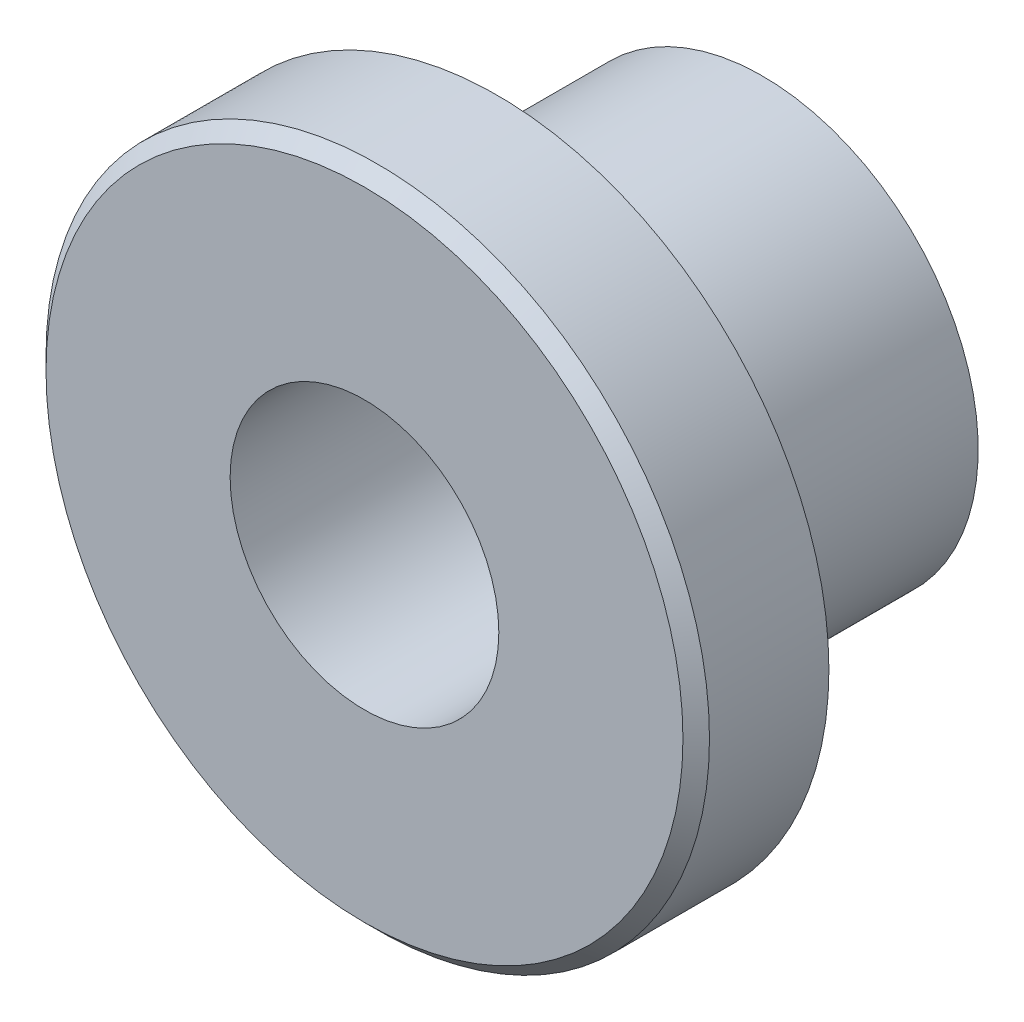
ISO-10303-21;
HEADER;
FILE_DESCRIPTION(('STEP AP214'),'2;1');
FILE_NAME('part.step','',(''),(''),'','','');
FILE_SCHEMA(('AUTOMOTIVE_DESIGN { 1 0 10303 214 1 1 1 1 }'));
ENDSEC;
DATA;
#1=APPLICATION_CONTEXT('core data for automotive mechanical design processes');
#2=APPLICATION_PROTOCOL_DEFINITION('international standard','automotive_design',2000,#1);
#3=PRODUCT_CONTEXT('',#1,'mechanical');
#4=PRODUCT('Part','Part','',(#3));
#5=PRODUCT_RELATED_PRODUCT_CATEGORY('part','',(#4));
#6=PRODUCT_DEFINITION_FORMATION('','',#4);
#7=PRODUCT_DEFINITION_CONTEXT('part definition',#1,'design');
#8=PRODUCT_DEFINITION('design','',#6,#7);
#9=PRODUCT_DEFINITION_SHAPE('','',#8);
#10=(LENGTH_UNIT() NAMED_UNIT(*) SI_UNIT(.MILLI.,.METRE.));
#11=(NAMED_UNIT(*) PLANE_ANGLE_UNIT() SI_UNIT($,.RADIAN.));
#12=(NAMED_UNIT(*) SI_UNIT($,.STERADIAN.) SOLID_ANGLE_UNIT());
#13=UNCERTAINTY_MEASURE_WITH_UNIT(LENGTH_MEASURE(1.E-05),#10,'distance_accuracy_value','');
#14=(GEOMETRIC_REPRESENTATION_CONTEXT(3) GLOBAL_UNCERTAINTY_ASSIGNED_CONTEXT((#13)) GLOBAL_UNIT_ASSIGNED_CONTEXT((#10,
#11,#12)) REPRESENTATION_CONTEXT('',''));
#15=CARTESIAN_POINT('',(0.,0.,0.));
#16=DIRECTION('',(0.,0.,1.));
#17=DIRECTION('',(1.,0.,0.));
#18=AXIS2_PLACEMENT_3D('',#15,#16,#17);
#19=CARTESIAN_POINT('',(0.,0.,-0.4));
#20=DIRECTION('',(0.,0.,1.));
#21=DIRECTION('',(1.,0.,0.));
#22=AXIS2_PLACEMENT_3D('',#19,#20,#21);
#23=TOROIDAL_SURFACE('',#22,6.9,0.4);
#24=CARTESIAN_POINT('',(0.,0.,0.));
#25=DIRECTION('',(0.,0.,-1.));
#26=DIRECTION('',(-1.,0.,0.));
#27=AXIS2_PLACEMENT_3D('',#24,#25,#26);
#28=CIRCLE('',#27,6.9);
#29=CARTESIAN_POINT('',(6.9,0.,0.));
#30=VERTEX_POINT('',#29);
#31=CARTESIAN_POINT('',(-6.9,0.,0.));
#32=VERTEX_POINT('',#31);
#33=EDGE_CURVE('E32',#30,#32,#28,.F.);
#34=ORIENTED_EDGE('',*,*,#33,.F.);
#35=CARTESIAN_POINT('',(0.,0.,0.));
#36=DIRECTION('',(0.,0.,-1.));
#37=DIRECTION('',(1.,0.,0.));
#38=AXIS2_PLACEMENT_3D('',#35,#36,#37);
#39=CIRCLE('',#38,6.9);
#40=EDGE_CURVE('E35',#32,#30,#39,.F.);
#41=ORIENTED_EDGE('',*,*,#40,.F.);
#42=EDGE_LOOP('',(#34,#41));
#43=FACE_BOUND('',#42,.T.);
#44=CARTESIAN_POINT('',(0.,0.,-0.4));
#45=DIRECTION('',(0.,0.,-1.));
#46=DIRECTION('',(-1.,0.,0.));
#47=AXIS2_PLACEMENT_3D('',#44,#45,#46);
#48=CIRCLE('',#47,6.5);
#49=CARTESIAN_POINT('',(-6.5,0.,-0.4));
#50=VERTEX_POINT('',#49);
#51=EDGE_CURVE('E39',#50,#50,#48,.T.);
#52=ORIENTED_EDGE('',*,*,#51,.F.);
#53=EDGE_LOOP('',(#52));
#54=FACE_BOUND('',#53,.T.);
#55=ADVANCED_FACE('F14',(#43,#54),#23,.F.);
#56=CARTESIAN_POINT('',(0.,0.,-0.4));
#57=DIRECTION('',(0.,0.,-1.));
#58=DIRECTION('',(-1.,0.,0.));
#59=AXIS2_PLACEMENT_3D('',#56,#57,#58);
#60=CYLINDRICAL_SURFACE('',#59,6.5);
#61=ORIENTED_EDGE('',*,*,#51,.T.);
#62=EDGE_LOOP('',(#61));
#63=FACE_BOUND('',#62,.T.);
#64=CARTESIAN_POINT('',(0.,0.,-8.));
#65=DIRECTION('',(0.,0.,-1.));
#66=DIRECTION('',(-1.,0.,0.));
#67=AXIS2_PLACEMENT_3D('',#64,#65,#66);
#68=CIRCLE('',#67,6.5);
#69=CARTESIAN_POINT('',(-6.5,0.,-8.));
#70=VERTEX_POINT('',#69);
#71=EDGE_CURVE('E43',#70,#70,#68,.T.);
#72=ORIENTED_EDGE('',*,*,#71,.F.);
#73=EDGE_LOOP('',(#72));
#74=FACE_BOUND('',#73,.T.);
#75=ADVANCED_FACE('F61',(#63,#74),#60,.T.);
#76=CARTESIAN_POINT('',(0.,0.,0.));
#77=DIRECTION('',(0.,0.,-1.));
#78=DIRECTION('',(-1.,0.,0.));
#79=AXIS2_PLACEMENT_3D('',#76,#77,#78);
#80=PLANE('',#79);
#81=CARTESIAN_POINT('',(0.,0.,0.));
#82=DIRECTION('',(0.,0.,1.));
#83=DIRECTION('',(1.,0.,0.));
#84=AXIS2_PLACEMENT_3D('',#81,#82,#83);
#85=CIRCLE('',#84,10.);
#86=CARTESIAN_POINT('',(10.,0.,0.));
#87=VERTEX_POINT('',#86);
#88=EDGE_CURVE('E101',#87,#87,#85,.T.);
#89=ORIENTED_EDGE('',*,*,#88,.F.);
#90=EDGE_LOOP('',(#89));
#91=FACE_BOUND('',#90,.T.);
#92=ORIENTED_EDGE('',*,*,#40,.T.);
#93=ORIENTED_EDGE('',*,*,#33,.T.);
#94=EDGE_LOOP('',(#92,#93));
#95=FACE_BOUND('',#94,.T.);
#96=ADVANCED_FACE('F42',(#91,#95),#80,.T.);
#97=CARTESIAN_POINT('',(0.,0.,-8.));
#98=DIRECTION('',(0.,0.,-1.));
#99=DIRECTION('',(-1.,0.,0.));
#100=AXIS2_PLACEMENT_3D('',#97,#98,#99);
#101=PLANE('',#100);
#102=ORIENTED_EDGE('',*,*,#71,.T.);
#103=EDGE_LOOP('',(#102));
#104=FACE_BOUND('',#103,.T.);
#105=CARTESIAN_POINT('',(0.,0.,-8.));
#106=DIRECTION('',(0.,0.,-1.));
#107=DIRECTION('',(-1.,0.,0.));
#108=AXIS2_PLACEMENT_3D('',#105,#106,#107);
#109=CIRCLE('',#108,4.05);
#110=CARTESIAN_POINT('',(-4.05,0.,-8.));
#111=VERTEX_POINT('',#110);
#112=EDGE_CURVE('E102',#111,#111,#109,.F.);
#113=ORIENTED_EDGE('',*,*,#112,.T.);
#114=EDGE_LOOP('',(#113));
#115=FACE_BOUND('',#114,.T.);
#116=ADVANCED_FACE('F60',(#104,#115),#101,.T.);
#117=CARTESIAN_POINT('',(0.,0.,0.));
#118=DIRECTION('',(0.,0.,1.));
#119=DIRECTION('',(1.,0.,0.));
#120=AXIS2_PLACEMENT_3D('',#117,#118,#119);
#121=CYLINDRICAL_SURFACE('',#120,10.);
#122=CARTESIAN_POINT('',(0.,0.,3.59999999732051));
#123=DIRECTION('',(0.,0.,-1.));
#124=DIRECTION('',(-1.,0.,0.));
#125=AXIS2_PLACEMENT_3D('',#122,#123,#124);
#126=CIRCLE('',#125,9.99999999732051);
#127=CARTESIAN_POINT('',(-9.99999999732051,0.,3.59999999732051));
#128=VERTEX_POINT('',#127);
#129=EDGE_CURVE('E98',#128,#128,#126,.F.);
#130=ORIENTED_EDGE('',*,*,#129,.F.);
#131=EDGE_LOOP('',(#130));
#132=FACE_BOUND('',#131,.T.);
#133=ORIENTED_EDGE('',*,*,#88,.T.);
#134=EDGE_LOOP('',(#133));
#135=FACE_BOUND('',#134,.T.);
#136=ADVANCED_FACE('F87',(#132,#135),#121,.T.);
#137=CARTESIAN_POINT('',(0.,0.,4.));
#138=DIRECTION('',(0.,0.,-1.));
#139=DIRECTION('',(-1.,0.,0.));
#140=AXIS2_PLACEMENT_3D('',#137,#138,#139);
#141=CYLINDRICAL_SURFACE('',#140,4.05);
#142=CARTESIAN_POINT('',(0.,0.,4.));
#143=DIRECTION('',(0.,0.,-1.));
#144=DIRECTION('',(-1.,0.,0.));
#145=AXIS2_PLACEMENT_3D('',#142,#143,#144);
#146=CIRCLE('',#145,4.05);
#147=CARTESIAN_POINT('',(-4.05,0.,4.));
#148=VERTEX_POINT('',#147);
#149=EDGE_CURVE('E25',#148,#148,#146,.T.);
#150=ORIENTED_EDGE('',*,*,#149,.F.);
#151=EDGE_LOOP('',(#150));
#152=FACE_BOUND('',#151,.T.);
#153=ORIENTED_EDGE('',*,*,#112,.F.);
#154=EDGE_LOOP('',(#153));
#155=FACE_BOUND('',#154,.T.);
#156=ADVANCED_FACE('F81',(#152,#155),#141,.F.);
#157=CARTESIAN_POINT('',(0.,0.,3.59999999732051));
#158=DIRECTION('',(0.,0.,-1.));
#159=DIRECTION('',(-1.,0.,0.));
#160=AXIS2_PLACEMENT_3D('',#157,#158,#159);
#161=CONICAL_SURFACE('',#160,9.99999999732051,0.785398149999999);
#162=ORIENTED_EDGE('',*,*,#129,.T.);
#163=EDGE_LOOP('',(#162));
#164=FACE_BOUND('',#163,.T.);
#165=CARTESIAN_POINT('',(0.,0.,4.00000000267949));
#166=DIRECTION('',(0.,0.,-1.));
#167=DIRECTION('',(-1.,0.,0.));
#168=AXIS2_PLACEMENT_3D('',#165,#166,#167);
#169=CIRCLE('',#168,9.60000000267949);
#170=CARTESIAN_POINT('',(-9.60000000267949,0.,4.00000000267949));
#171=VERTEX_POINT('',#170);
#172=EDGE_CURVE('E9',#171,#171,#169,.F.);
#173=ORIENTED_EDGE('',*,*,#172,.F.);
#174=EDGE_LOOP('',(#173));
#175=FACE_BOUND('',#174,.T.);
#176=ADVANCED_FACE('F75',(#164,#175),#161,.T.);
#177=CARTESIAN_POINT('',(0.,0.,4.));
#178=DIRECTION('',(0.,0.,1.));
#179=DIRECTION('',(1.,0.,0.));
#180=AXIS2_PLACEMENT_3D('',#177,#178,#179);
#181=PLANE('',#180);
#182=ORIENTED_EDGE('',*,*,#172,.T.);
#183=EDGE_LOOP('',(#182));
#184=FACE_BOUND('',#183,.T.);
#185=ORIENTED_EDGE('',*,*,#149,.T.);
#186=EDGE_LOOP('',(#185));
#187=FACE_BOUND('',#186,.T.);
#188=ADVANCED_FACE('F73',(#184,#187),#181,.T.);
#189=CLOSED_SHELL('',(#55,#75,#96,#116,#136,#156,#176,#188));
#190=MANIFOLD_SOLID_BREP('B1',#189);
#191=ADVANCED_BREP_SHAPE_REPRESENTATION('',(#18,#190),#14);
#192=SHAPE_DEFINITION_REPRESENTATION(#9,#191);
ENDSEC;
END-ISO-10303-21;
